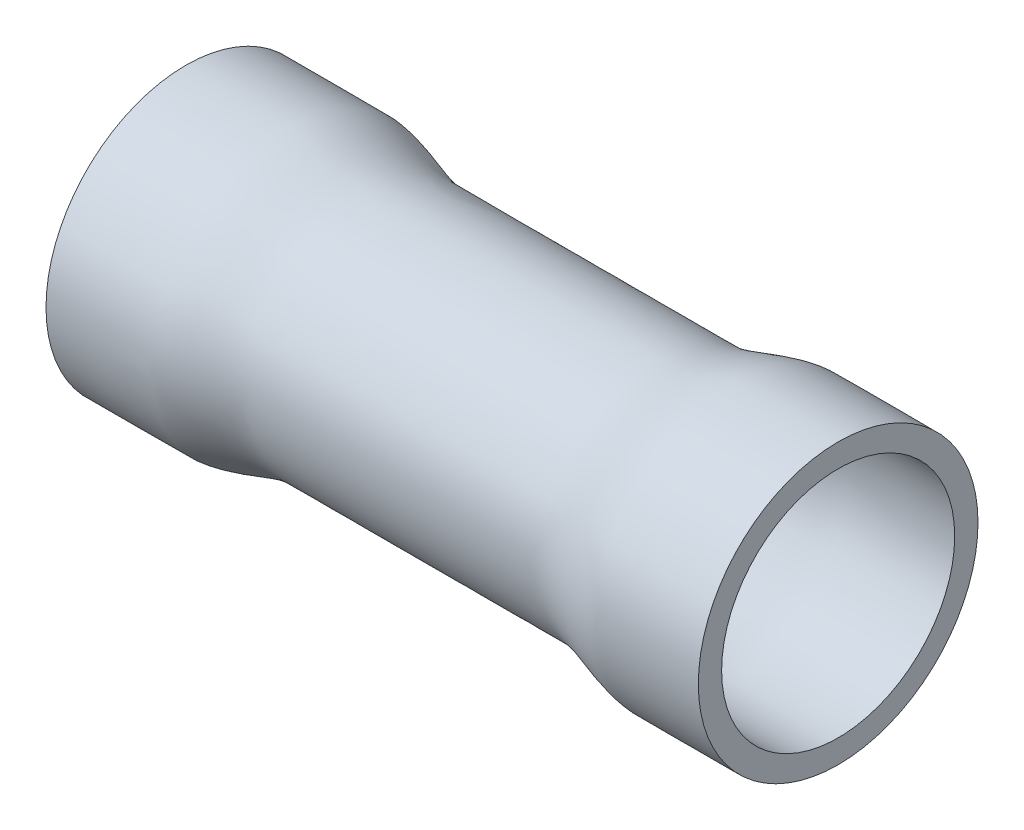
from build123d import *

# Parameters (mm, degrees)
BOSS_EXTRUDE1_DEPTH      = 3
BOSS_EXTRUDE1_DEPTH_BACK = 3
FILTERSKETCH_R           = 2
FILTERSKETCH_R_2         = 1.5


with BuildPart() as part:
    # FilterSketch → Boss-Extrude1 (new, two sides: drawn at the far end of the back side and taken through both)
    with BuildSketch(Plane(origin=(0, 0, 0), x_dir=(0, 0, -1), z_dir=(1, 0, 0)).offset(-BOSS_EXTRUDE1_DEPTH_BACK)):
        Circle(FILTERSKETCH_R)
        Circle(FILTERSKETCH_R_2, mode=Mode.SUBTRACT)
    extrude(amount=BOSS_EXTRUDE1_DEPTH + BOSS_EXTRUDE1_DEPTH_BACK)


with BuildPart() as body_2:
    # Sketch2 → Revolve1 (revolve)
    with BuildSketch(Plane.XY, mode=Mode.PRIVATE) as revolve1_sk:
        with BuildLine():
            Line((-7, 3.001192), (-7, 2.501192))
            add(Edge.make_bspline(
                [(-7, 2.501192), (-6.475, 2.501192), (-5.95, 2.501192), (-5.425, 2.501192), (-5.365363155, 2.501192), (-5.246089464, 2.501192), (-5.067178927, 2.501192), (-4.947905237, 2.501192), (-4.888268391, 2.501192), (-4.854770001, 2.501192), (-4.787773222, 2.501192), (-4.686904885, 2.492442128), (-4.620908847, 2.480905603), (-4.587910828, 2.475137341), (-4.56797972, 2.471653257), (-4.528117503, 2.464685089), (-4.468698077, 2.452076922), (-4.429224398, 2.443158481), (-4.409533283, 2.43850575), (-4.091175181, 2.36328225), (-3.786601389, 2.23790975), (-3.475081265, 2.16268625), (-3.456111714, 2.158105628), (-3.418084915, 2.149307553), (-3.36084555, 2.136832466), (-3.322443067, 2.129864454), (-3.303241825, 2.126380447), (-3.271063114, 2.120541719), (-3.206705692, 2.108864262), (-3.108201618, 2.1), (-3.042793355, 2.1), (-3.010089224, 2.1), (-2.955723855, 2.1), (-2.846993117, 2.1), (-2.68389701, 2.1), (-2.575166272, 2.1), (-2.520800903, 2.1), (-0.840266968, 2.1), (0.840266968, 2.1), (2.520800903, 2.1), (2.575166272, 2.1), (2.68389701, 2.1), (2.846993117, 2.1), (2.955723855, 2.1), (3.010089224, 2.1), (3.042793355, 2.1), (3.108201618, 2.1), (3.206705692, 2.108864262), (3.271063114, 2.120541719), (3.303241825, 2.126380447), (3.322443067, 2.129864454), (3.36084555, 2.136832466), (3.418084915, 2.149307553), (3.456111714, 2.158105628), (3.475081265, 2.16268625), (3.786601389, 2.23790975), (4.091175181, 2.36328225), (4.409533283, 2.43850575), (4.429224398, 2.443158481), (4.468698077, 2.452076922), (4.528117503, 2.464685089), (4.56797972, 2.471653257), (4.587910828, 2.475137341), (4.620908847, 2.480905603), (4.686904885, 2.492442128), (4.787773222, 2.501192), (4.854770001, 2.501192), (4.888268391, 2.501192), (4.947905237, 2.501192), (5.067178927, 2.501192), (5.246089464, 2.501192), (5.365363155, 2.501192), (5.425, 2.501192), (5.95, 2.501192), (6.475, 2.501192), (7, 2.501192)],
                knots=[0, 0, 0, 0, 0.110464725, 0.110464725, 0.110464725, 0.123012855, 0.135560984, 0.148109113, 0.148109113, 0.148109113, 0.155157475, 0.162205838, 0.169254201, 0.169254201, 0.169254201, 0.173511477, 0.177768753, 0.182026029, 0.182026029, 0.182026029, 0.250855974, 0.250855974, 0.250855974, 0.255047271, 0.259238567, 0.263429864, 0.263429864, 0.263429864, 0.270453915, 0.277477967, 0.284502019, 0.284502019, 0.284502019, 0.296178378, 0.307854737, 0.319531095, 0.319531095, 0.319531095, 0.680468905, 0.680468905, 0.680468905, 0.692145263, 0.703821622, 0.715497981, 0.715497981, 0.715497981, 0.722522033, 0.729546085, 0.736570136, 0.736570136, 0.736570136, 0.740761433, 0.744952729, 0.749144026, 0.749144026, 0.749144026, 0.817973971, 0.817973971, 0.817973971, 0.822231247, 0.826488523, 0.830745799, 0.830745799, 0.830745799, 0.837794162, 0.844842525, 0.851890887, 0.851890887, 0.851890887, 0.864439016, 0.876987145, 0.889535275, 0.889535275, 0.889535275, 1, 1, 1, 1], degree=3))
            Line((7, 2.501192), (7, 3.001192))
            add(Edge.make_bspline(
                [(-7, 3.001192), (-6.475, 3.001192), (-5.95, 3.001192), (-5.425, 3.001192), (-5.365363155, 3.001192), (-5.246089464, 3.001192), (-5.067178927, 3.001192), (-4.947905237, 3.001192), (-4.888268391, 3.001192), (-4.854770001, 3.001192), (-4.787773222, 3.001192), (-4.686904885, 2.992442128), (-4.620908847, 2.980905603), (-4.587910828, 2.975137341), (-4.56797972, 2.971653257), (-4.528117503, 2.964685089), (-4.468698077, 2.952076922), (-4.429224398, 2.943158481), (-4.409533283, 2.93850575), (-4.091175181, 2.86328225), (-3.786601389, 2.73790975), (-3.475081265, 2.66268625), (-3.456111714, 2.658105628), (-3.418084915, 2.649307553), (-3.36084555, 2.636832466), (-3.322443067, 2.629864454), (-3.303241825, 2.626380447), (-3.271063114, 2.620541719), (-3.206705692, 2.608864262), (-3.108201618, 2.6), (-3.042793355, 2.6), (-3.010089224, 2.6), (-2.955723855, 2.6), (-2.846993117, 2.6), (-2.68389701, 2.6), (-2.575166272, 2.6), (-2.520800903, 2.6), (-0.840266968, 2.6), (0.840266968, 2.6), (2.520800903, 2.6), (2.575166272, 2.6), (2.68389701, 2.6), (2.846993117, 2.6), (2.955723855, 2.6), (3.010089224, 2.6), (3.042793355, 2.6), (3.108201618, 2.6), (3.206705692, 2.608864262), (3.271063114, 2.620541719), (3.303241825, 2.626380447), (3.322443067, 2.629864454), (3.36084555, 2.636832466), (3.418084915, 2.649307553), (3.456111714, 2.658105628), (3.475081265, 2.66268625), (3.786601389, 2.73790975), (4.091175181, 2.86328225), (4.409533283, 2.93850575), (4.429224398, 2.943158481), (4.468698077, 2.952076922), (4.528117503, 2.964685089), (4.56797972, 2.971653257), (4.587910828, 2.975137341), (4.620908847, 2.980905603), (4.686904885, 2.992442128), (4.787773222, 3.001192), (4.854770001, 3.001192), (4.888268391, 3.001192), (4.947905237, 3.001192), (5.067178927, 3.001192), (5.246089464, 3.001192), (5.365363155, 3.001192), (5.425, 3.001192), (5.95, 3.001192), (6.475, 3.001192), (7, 3.001192)],
                knots=[0, 0, 0, 0, 0.110464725, 0.110464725, 0.110464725, 0.123012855, 0.135560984, 0.148109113, 0.148109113, 0.148109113, 0.155157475, 0.162205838, 0.169254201, 0.169254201, 0.169254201, 0.173511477, 0.177768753, 0.182026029, 0.182026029, 0.182026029, 0.250855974, 0.250855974, 0.250855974, 0.255047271, 0.259238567, 0.263429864, 0.263429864, 0.263429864, 0.270453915, 0.277477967, 0.284502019, 0.284502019, 0.284502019, 0.296178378, 0.307854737, 0.319531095, 0.319531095, 0.319531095, 0.680468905, 0.680468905, 0.680468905, 0.692145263, 0.703821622, 0.715497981, 0.715497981, 0.715497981, 0.722522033, 0.729546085, 0.736570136, 0.736570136, 0.736570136, 0.740761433, 0.744952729, 0.749144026, 0.749144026, 0.749144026, 0.817973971, 0.817973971, 0.817973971, 0.822231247, 0.826488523, 0.830745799, 0.830745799, 0.830745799, 0.837794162, 0.844842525, 0.851890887, 0.851890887, 0.851890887, 0.864439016, 0.876987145, 0.889535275, 0.889535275, 0.889535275, 1, 1, 1, 1], degree=3))
        make_face()
    revolve(revolve1_sk.sketch.rotate(Axis((-12.5, 0, 0), (1, 0, 0)), 270), axis=Axis((-12.5, 0, 0), (1, 0, 0)))


solid = Compound([part.part, body_2.part])
